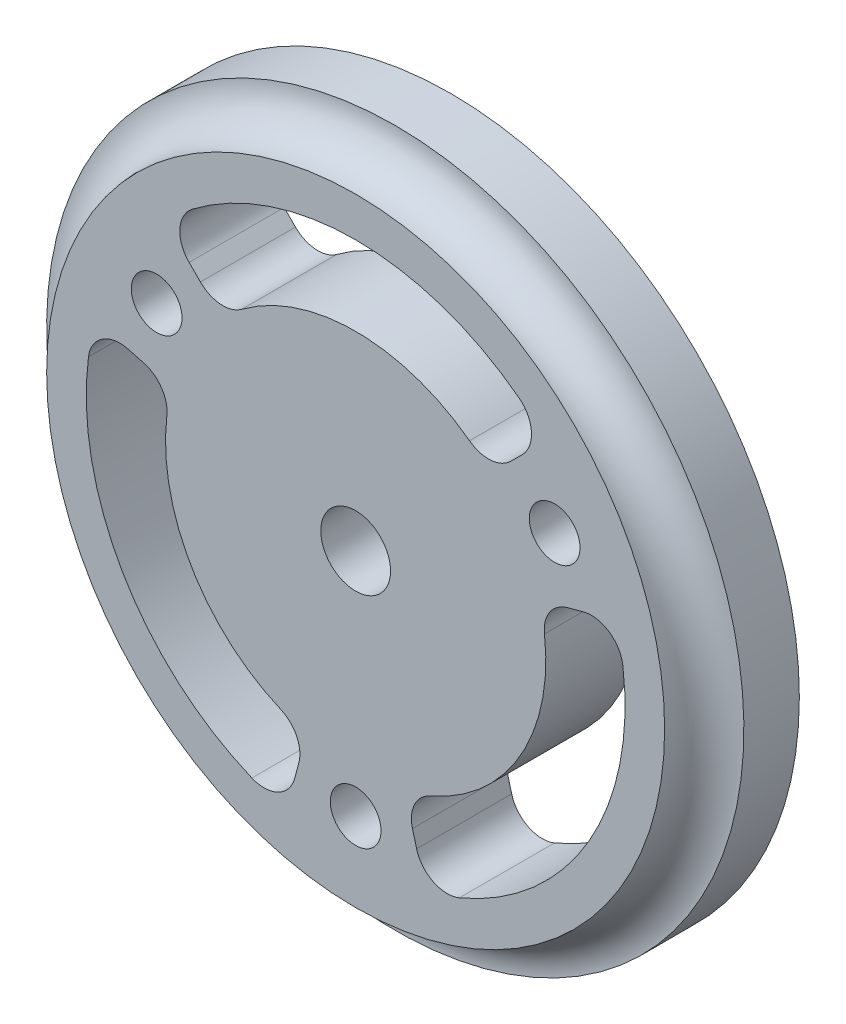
ISO-10303-21;
HEADER;
FILE_DESCRIPTION(('STEP AP214'),'2;1');
FILE_NAME('part.step','',(''),(''),'','','');
FILE_SCHEMA(('AUTOMOTIVE_DESIGN { 1 0 10303 214 1 1 1 1 }'));
ENDSEC;
DATA;
#1=APPLICATION_CONTEXT('core data for automotive mechanical design processes');
#2=APPLICATION_PROTOCOL_DEFINITION('international standard','automotive_design',2000,#1);
#3=PRODUCT_CONTEXT('',#1,'mechanical');
#4=PRODUCT('Part','Part','',(#3));
#5=PRODUCT_RELATED_PRODUCT_CATEGORY('part','',(#4));
#6=PRODUCT_DEFINITION_FORMATION('','',#4);
#7=PRODUCT_DEFINITION_CONTEXT('part definition',#1,'design');
#8=PRODUCT_DEFINITION('design','',#6,#7);
#9=PRODUCT_DEFINITION_SHAPE('','',#8);
#10=(LENGTH_UNIT() NAMED_UNIT(*) SI_UNIT(.MILLI.,.METRE.));
#11=(NAMED_UNIT(*) PLANE_ANGLE_UNIT() SI_UNIT($,.RADIAN.));
#12=(NAMED_UNIT(*) SI_UNIT($,.STERADIAN.) SOLID_ANGLE_UNIT());
#13=UNCERTAINTY_MEASURE_WITH_UNIT(LENGTH_MEASURE(1.E-05),#10,'distance_accuracy_value','');
#14=(GEOMETRIC_REPRESENTATION_CONTEXT(3) GLOBAL_UNCERTAINTY_ASSIGNED_CONTEXT((#13)) GLOBAL_UNIT_ASSIGNED_CONTEXT((#10,
#11,#12)) REPRESENTATION_CONTEXT('',''));
#15=CARTESIAN_POINT('',(0.,0.,0.));
#16=DIRECTION('',(0.,0.,1.));
#17=DIRECTION('',(1.,0.,0.));
#18=AXIS2_PLACEMENT_3D('',#15,#16,#17);
#19=CARTESIAN_POINT('',(0.,0.,6.));
#20=DIRECTION('',(0.,0.,1.));
#21=DIRECTION('',(1.,0.,0.));
#22=AXIS2_PLACEMENT_3D('',#19,#20,#21);
#23=PLANE('',#22);
#24=CARTESIAN_POINT('',(0.,0.,5.99999999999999));
#25=DIRECTION('',(0.,0.,-1.));
#26=DIRECTION('',(0.,1.,0.));
#27=AXIS2_PLACEMENT_3D('',#24,#25,#26);
#28=CIRCLE('',#27,19.5);
#29=CARTESIAN_POINT('',(0.,19.5,6.));
#30=VERTEX_POINT('',#29);
#31=EDGE_CURVE('E426',#30,#30,#28,.T.);
#32=ORIENTED_EDGE('',*,*,#31,.F.);
#33=EDGE_LOOP('',(#32));
#34=FACE_BOUND('',#33,.T.);
#35=CARTESIAN_POINT('',(0.,0.,6.));
#36=DIRECTION('',(0.,0.,1.));
#37=DIRECTION('',(1.,0.,0.));
#38=AXIS2_PLACEMENT_3D('',#35,#36,#37);
#39=CIRCLE('',#38,17.0000000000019);
#40=CARTESIAN_POINT('',(6.55006981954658,-15.6874658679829,6.));
#41=VERTEX_POINT('',#40);
#42=CARTESIAN_POINT('',(16.8607788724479,2.17120607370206,6.));
#43=VERTEX_POINT('',#42);
#44=EDGE_CURVE('E262',#41,#43,#39,.T.);
#45=ORIENTED_EDGE('',*,*,#44,.F.);
#46=CARTESIAN_POINT('',(5.77947337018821,-13.8418816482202,6.));
#47=DIRECTION('',(0.,0.,1.));
#48=DIRECTION('',(-1.,0.,0.));
#49=AXIS2_PLACEMENT_3D('',#46,#47,#48);
#50=CIRCLE('',#49,2.00000000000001);
#51=CARTESIAN_POINT('',(3.84762171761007,-14.3595197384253,6.));
#52=VERTEX_POINT('',#51);
#53=EDGE_CURVE('E260',#52,#41,#50,.T.);
#54=ORIENTED_EDGE('',*,*,#53,.F.);
#55=DIRECTION('',(0.258819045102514,-0.96592582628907,0.));
#56=VECTOR('',#55,1.);
#57=CARTESIAN_POINT('',(3.58630188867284,-13.3842608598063,6.));
#58=LINE('',#57,#56);
#59=CARTESIAN_POINT('',(3.58630188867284,-13.3842608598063,6.));
#60=VERTEX_POINT('',#59);
#61=EDGE_CURVE('E276',#60,#52,#58,.T.);
#62=ORIENTED_EDGE('',*,*,#61,.F.);
#63=CARTESIAN_POINT('',(5.51815354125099,-12.8666227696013,6.));
#64=DIRECTION('',(0.,0.,1.));
#65=DIRECTION('',(1.,0.,0.));
#66=AXIS2_PLACEMENT_3D('',#63,#64,#65);
#67=CIRCLE('',#66,1.99999999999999);
#68=CARTESIAN_POINT('',(4.72984589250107,-11.0285338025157,6.));
#69=VERTEX_POINT('',#68);
#70=EDGE_CURVE('E273',#69,#60,#67,.T.);
#71=ORIENTED_EDGE('',*,*,#70,.F.);
#72=CARTESIAN_POINT('',(0.,0.,6.));
#73=DIRECTION('',(0.,0.,-1.));
#74=DIRECTION('',(1.,0.,0.));
#75=AXIS2_PLACEMENT_3D('',#72,#73,#74);
#76=CIRCLE('',#75,12.0000000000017);
#77=CARTESIAN_POINT('',(11.9159133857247,1.41810020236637,6.));
#78=VERTEX_POINT('',#77);
#79=EDGE_CURVE('E271',#78,#69,#76,.T.);
#80=ORIENTED_EDGE('',*,*,#79,.F.);
#81=CARTESIAN_POINT('',(13.9018989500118,1.65445023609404,6.));
#82=DIRECTION('',(0.,0.,1.));
#83=DIRECTION('',(-1.,0.,0.));
#84=AXIS2_PLACEMENT_3D('',#81,#82,#83);
#85=CIRCLE('',#84,1.99999999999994);
#86=CARTESIAN_POINT('',(13.3842608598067,3.58630188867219,6.));
#87=VERTEX_POINT('',#86);
#88=EDGE_CURVE('E269',#87,#78,#85,.T.);
#89=ORIENTED_EDGE('',*,*,#88,.F.);
#90=DIRECTION('',(-0.96592582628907,-0.258819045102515,0.));
#91=VECTOR('',#90,1.);
#92=CARTESIAN_POINT('',(13.3842608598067,3.58630188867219,6.));
#93=LINE('',#92,#91);
#94=CARTESIAN_POINT('',(14.3595197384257,3.84762171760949,6.));
#95=VERTEX_POINT('',#94);
#96=EDGE_CURVE('E267',#95,#87,#93,.T.);
#97=ORIENTED_EDGE('',*,*,#96,.F.);
#98=CARTESIAN_POINT('',(14.8771578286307,1.91577006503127,6.));
#99=DIRECTION('',(0.,0.,1.));
#100=DIRECTION('',(1.,0.,0.));
#101=AXIS2_PLACEMENT_3D('',#98,#99,#100);
#102=CIRCLE('',#101,2.00000000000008);
#103=EDGE_CURVE('E265',#43,#95,#102,.T.);
#104=ORIENTED_EDGE('',*,*,#103,.F.);
#105=EDGE_LOOP('',(#45,#54,#62,#71,#80,#89,#97,#104));
#106=FACE_BOUND('',#105,.T.);
#107=CARTESIAN_POINT('',(12.5573683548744,7.24999999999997,6.));
#108=DIRECTION('',(0.,0.,1.));
#109=DIRECTION('',(1.,0.,0.));
#110=AXIS2_PLACEMENT_3D('',#107,#108,#109);
#111=CIRCLE('',#110,1.59999999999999);
#112=CARTESIAN_POINT('',(14.1573683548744,7.24999999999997,6.));
#113=VERTEX_POINT('',#112);
#114=EDGE_CURVE('E325',#113,#113,#111,.T.);
#115=ORIENTED_EDGE('',*,*,#114,.F.);
#116=EDGE_LOOP('',(#115));
#117=FACE_BOUND('',#116,.T.);
#118=CARTESIAN_POINT('',(-9.09768445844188,11.9261115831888,6.));
#119=DIRECTION('',(0.,0.,1.));
#120=DIRECTION('',(1.,0.,0.));
#121=AXIS2_PLACEMENT_3D('',#118,#119,#120);
#122=CIRCLE('',#121,2.00000000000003);
#123=CARTESIAN_POINT('',(-10.3107090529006,13.5162597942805,6.));
#124=VERTEX_POINT('',#123);
#125=CARTESIAN_POINT('',(-10.511898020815,10.5118980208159,6.));
#126=VERTEX_POINT('',#125);
#127=EDGE_CURVE('E339',#124,#126,#122,.T.);
#128=ORIENTED_EDGE('',*,*,#127,.F.);
#129=CARTESIAN_POINT('',(0.,0.,6.));
#130=DIRECTION('',(0.,0.,1.));
#131=DIRECTION('',(1.,0.,0.));
#132=AXIS2_PLACEMENT_3D('',#129,#130,#131);
#133=CIRCLE('',#132,17.0000000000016);
#134=CARTESIAN_POINT('',(10.3107090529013,13.5162597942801,6.));
#135=VERTEX_POINT('',#134);
#136=EDGE_CURVE('E337',#135,#124,#133,.T.);
#137=ORIENTED_EDGE('',*,*,#136,.F.);
#138=CARTESIAN_POINT('',(9.09768445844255,11.9261115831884,6.));
#139=DIRECTION('',(0.,0.,1.));
#140=DIRECTION('',(-1.,0.,0.));
#141=AXIS2_PLACEMENT_3D('',#138,#139,#140);
#142=CIRCLE('',#141,1.99999999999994);
#143=CARTESIAN_POINT('',(10.5118980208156,10.5118980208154,6.));
#144=VERTEX_POINT('',#143);
#145=EDGE_CURVE('E353',#144,#135,#142,.T.);
#146=ORIENTED_EDGE('',*,*,#145,.F.);
#147=DIRECTION('',(0.70710678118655,0.707106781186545,0.));
#148=VECTOR('',#147,1.);
#149=CARTESIAN_POINT('',(9.79795897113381,9.79795897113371,6.));
#150=LINE('',#149,#148);
#151=CARTESIAN_POINT('',(9.79795897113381,9.79795897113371,6.));
#152=VERTEX_POINT('',#151);
#153=EDGE_CURVE('E350',#152,#144,#150,.T.);
#154=ORIENTED_EDGE('',*,*,#153,.F.);
#155=CARTESIAN_POINT('',(8.38374540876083,11.2121725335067,6.));
#156=DIRECTION('',(0.,0.,1.));
#157=DIRECTION('',(1.,0.,0.));
#158=AXIS2_PLACEMENT_3D('',#155,#156,#157);
#159=CIRCLE('',#158,1.99999999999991);
#160=CARTESIAN_POINT('',(7.18606749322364,9.61043360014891,6.));
#161=VERTEX_POINT('',#160);
#162=EDGE_CURVE('E348',#161,#152,#159,.T.);
#163=ORIENTED_EDGE('',*,*,#162,.F.);
#164=CARTESIAN_POINT('',(0.,0.,6.));
#165=DIRECTION('',(0.,0.,-1.));
#166=DIRECTION('',(1.,0.,0.));
#167=AXIS2_PLACEMENT_3D('',#164,#165,#166);
#168=CIRCLE('',#167,12.0000000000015);
#169=CARTESIAN_POINT('',(-7.18606749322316,9.61043360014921,6.));
#170=VERTEX_POINT('',#169);
#171=EDGE_CURVE('E346',#170,#161,#168,.T.);
#172=ORIENTED_EDGE('',*,*,#171,.F.);
#173=CARTESIAN_POINT('',(-8.38374540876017,11.212172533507,6.));
#174=DIRECTION('',(0.,0.,1.));
#175=DIRECTION('',(-1.,0.,0.));
#176=AXIS2_PLACEMENT_3D('',#173,#174,#175);
#177=CIRCLE('',#176,1.99999999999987);
#178=CARTESIAN_POINT('',(-9.79795897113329,9.79795897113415,6.));
#179=VERTEX_POINT('',#178);
#180=EDGE_CURVE('E344',#179,#170,#177,.T.);
#181=ORIENTED_EDGE('',*,*,#180,.F.);
#182=DIRECTION('',(0.707106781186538,-0.707106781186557,0.));
#183=VECTOR('',#182,1.);
#184=CARTESIAN_POINT('',(-9.79795897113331,9.79795897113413,6.));
#185=LINE('',#184,#183);
#186=EDGE_CURVE('E342',#126,#179,#185,.T.);
#187=ORIENTED_EDGE('',*,*,#186,.F.);
#188=EDGE_LOOP('',(#128,#137,#146,#154,#163,#172,#181,#187));
#189=FACE_BOUND('',#188,.T.);
#190=CARTESIAN_POINT('',(0.,0.,6.));
#191=DIRECTION('',(0.,0.,1.));
#192=DIRECTION('',(1.,0.,0.));
#193=AXIS2_PLACEMENT_3D('',#190,#191,#192);
#194=CIRCLE('',#193,2.2);
#195=CARTESIAN_POINT('',(2.2,0.,6.));
#196=VERTEX_POINT('',#195);
#197=EDGE_CURVE('E40',#196,#196,#194,.T.);
#198=ORIENTED_EDGE('',*,*,#197,.F.);
#199=EDGE_LOOP('',(#198));
#200=FACE_BOUND('',#199,.T.);
#201=CARTESIAN_POINT('',(0.,-14.5,6.));
#202=DIRECTION('',(0.,0.,1.));
#203=DIRECTION('',(1.,0.,0.));
#204=AXIS2_PLACEMENT_3D('',#201,#202,#203);
#205=CIRCLE('',#204,1.59999999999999);
#206=CARTESIAN_POINT('',(1.5999999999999,-14.5,6.));
#207=VERTEX_POINT('',#206);
#208=EDGE_CURVE('E331',#207,#207,#205,.T.);
#209=ORIENTED_EDGE('',*,*,#208,.F.);
#210=EDGE_LOOP('',(#209));
#211=FACE_BOUND('',#210,.T.);
#212=CARTESIAN_POINT('',(-12.5573683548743,7.25000000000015,6.));
#213=DIRECTION('',(0.,0.,1.));
#214=DIRECTION('',(1.,0.,0.));
#215=AXIS2_PLACEMENT_3D('',#212,#213,#214);
#216=CIRCLE('',#215,1.59999999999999);
#217=CARTESIAN_POINT('',(-10.9573683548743,7.25000000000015,6.));
#218=VERTEX_POINT('',#217);
#219=EDGE_CURVE('E319',#218,#218,#216,.T.);
#220=ORIENTED_EDGE('',*,*,#219,.F.);
#221=EDGE_LOOP('',(#220));
#222=FACE_BOUND('',#221,.T.);
#223=CARTESIAN_POINT('',(0.,0.,6.));
#224=DIRECTION('',(0.,0.,1.));
#225=DIRECTION('',(1.,0.,0.));
#226=AXIS2_PLACEMENT_3D('',#223,#224,#225);
#227=CIRCLE('',#226,17.0000000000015);
#228=CARTESIAN_POINT('',(-16.8607788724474,2.1712060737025,6.));
#229=VERTEX_POINT('',#228);
#230=CARTESIAN_POINT('',(-6.55006981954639,-15.6874658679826,6.));
#231=VERTEX_POINT('',#230);
#232=EDGE_CURVE('E201',#229,#231,#227,.T.);
#233=ORIENTED_EDGE('',*,*,#232,.F.);
#234=CARTESIAN_POINT('',(-14.87715782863,1.91577006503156,6.));
#235=DIRECTION('',(0.,0.,1.));
#236=DIRECTION('',(-1.,0.,0.));
#237=AXIS2_PLACEMENT_3D('',#234,#235,#236);
#238=CIRCLE('',#237,2.00000000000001);
#239=CARTESIAN_POINT('',(-14.3595197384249,3.8476217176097,6.));
#240=VERTEX_POINT('',#239);
#241=EDGE_CURVE('E193',#240,#229,#238,.T.);
#242=ORIENTED_EDGE('',*,*,#241,.F.);
#243=DIRECTION('',(-0.965925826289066,0.258819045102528,0.));
#244=VECTOR('',#243,1.);
#245=CARTESIAN_POINT('',(-13.384260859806,3.58630188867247,6.));
#246=LINE('',#245,#244);
#247=CARTESIAN_POINT('',(-13.384260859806,3.58630188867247,6.));
#248=VERTEX_POINT('',#247);
#249=EDGE_CURVE('E227',#248,#240,#246,.T.);
#250=ORIENTED_EDGE('',*,*,#249,.F.);
#251=CARTESIAN_POINT('',(-13.901898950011,1.65445023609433,6.));
#252=DIRECTION('',(0.,0.,1.));
#253=DIRECTION('',(1.,0.,0.));
#254=AXIS2_PLACEMENT_3D('',#251,#252,#253);
#255=CIRCLE('',#254,1.99999999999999);
#256=CARTESIAN_POINT('',(-11.9159133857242,1.41810020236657,6.));
#257=VERTEX_POINT('',#256);
#258=EDGE_CURVE('E225',#257,#248,#255,.T.);
#259=ORIENTED_EDGE('',*,*,#258,.F.);
#260=CARTESIAN_POINT('',(0.,0.,6.));
#261=DIRECTION('',(0.,0.,-1.));
#262=DIRECTION('',(1.,0.,0.));
#263=AXIS2_PLACEMENT_3D('',#260,#261,#262);
#264=CIRCLE('',#263,12.0000000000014);
#265=CARTESIAN_POINT('',(-4.72984589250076,-11.0285338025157,6.));
#266=VERTEX_POINT('',#265);
#267=EDGE_CURVE('E223',#266,#257,#264,.T.);
#268=ORIENTED_EDGE('',*,*,#267,.F.);
#269=CARTESIAN_POINT('',(-5.51815354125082,-12.8666227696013,6.));
#270=DIRECTION('',(0.,0.,1.));
#271=DIRECTION('',(-1.,0.,0.));
#272=AXIS2_PLACEMENT_3D('',#269,#270,#271);
#273=CIRCLE('',#272,1.99999999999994);
#274=CARTESIAN_POINT('',(-3.58630188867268,-13.3842608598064,6.));
#275=VERTEX_POINT('',#274);
#276=EDGE_CURVE('E221',#275,#266,#273,.T.);
#277=ORIENTED_EDGE('',*,*,#276,.F.);
#278=DIRECTION('',(0.258819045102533,0.965925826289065,0.));
#279=VECTOR('',#278,1.);
#280=CARTESIAN_POINT('',(-3.58630188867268,-13.3842608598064,6.));
#281=LINE('',#280,#279);
#282=CARTESIAN_POINT('',(-3.84762171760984,-14.3595197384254,6.));
#283=VERTEX_POINT('',#282);
#284=EDGE_CURVE('E216',#283,#275,#281,.T.);
#285=ORIENTED_EDGE('',*,*,#284,.F.);
#286=CARTESIAN_POINT('',(-5.77947337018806,-13.8418816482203,6.));
#287=DIRECTION('',(0.,0.,1.));
#288=DIRECTION('',(1.,0.,0.));
#289=AXIS2_PLACEMENT_3D('',#286,#287,#288);
#290=CIRCLE('',#289,2.00000000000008);
#291=EDGE_CURVE('E214',#231,#283,#290,.T.);
#292=ORIENTED_EDGE('',*,*,#291,.F.);
#293=EDGE_LOOP('',(#233,#242,#250,#259,#268,#277,#285,#292));
#294=FACE_BOUND('',#293,.T.);
#295=ADVANCED_FACE('F32',(#34,#106,#117,#189,#200,#211,#222,#294),#23,.T.);
#296=CARTESIAN_POINT('',(0.,0.,0.));
#297=DIRECTION('',(0.,0.,1.));
#298=DIRECTION('',(1.,0.,0.));
#299=AXIS2_PLACEMENT_3D('',#296,#297,#298);
#300=PLANE('',#299);
#301=CARTESIAN_POINT('',(5.77947337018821,-13.8418816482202,0.));
#302=DIRECTION('',(0.,0.,1.));
#303=DIRECTION('',(-1.,0.,0.));
#304=AXIS2_PLACEMENT_3D('',#301,#302,#303);
#305=CIRCLE('',#304,2.00000000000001);
#306=CARTESIAN_POINT('',(3.84762171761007,-14.3595197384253,0.));
#307=VERTEX_POINT('',#306);
#308=CARTESIAN_POINT('',(6.55006981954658,-15.6874658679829,0.));
#309=VERTEX_POINT('',#308);
#310=EDGE_CURVE('E209',#307,#309,#305,.T.);
#311=ORIENTED_EDGE('',*,*,#310,.T.);
#312=CARTESIAN_POINT('',(0.,0.,0.));
#313=DIRECTION('',(0.,0.,1.));
#314=DIRECTION('',(1.,0.,0.));
#315=AXIS2_PLACEMENT_3D('',#312,#313,#314);
#316=CIRCLE('',#315,17.0000000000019);
#317=CARTESIAN_POINT('',(16.8607788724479,2.17120607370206,0.));
#318=VERTEX_POINT('',#317);
#319=EDGE_CURVE('E281',#309,#318,#316,.T.);
#320=ORIENTED_EDGE('',*,*,#319,.T.);
#321=CARTESIAN_POINT('',(14.8771578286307,1.91577006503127,0.));
#322=DIRECTION('',(0.,0.,1.));
#323=DIRECTION('',(1.,0.,0.));
#324=AXIS2_PLACEMENT_3D('',#321,#322,#323);
#325=CIRCLE('',#324,2.00000000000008);
#326=CARTESIAN_POINT('',(14.3595197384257,3.84762171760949,0.));
#327=VERTEX_POINT('',#326);
#328=EDGE_CURVE('E284',#318,#327,#325,.T.);
#329=ORIENTED_EDGE('',*,*,#328,.T.);
#330=DIRECTION('',(-0.96592582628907,-0.258819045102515,0.));
#331=VECTOR('',#330,1.);
#332=CARTESIAN_POINT('',(13.3842608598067,3.58630188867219,0.));
#333=LINE('',#332,#331);
#334=CARTESIAN_POINT('',(13.3842608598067,3.58630188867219,0.));
#335=VERTEX_POINT('',#334);
#336=EDGE_CURVE('E287',#327,#335,#333,.T.);
#337=ORIENTED_EDGE('',*,*,#336,.T.);
#338=CARTESIAN_POINT('',(13.9018989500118,1.65445023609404,0.));
#339=DIRECTION('',(0.,0.,1.));
#340=DIRECTION('',(-1.,0.,0.));
#341=AXIS2_PLACEMENT_3D('',#338,#339,#340);
#342=CIRCLE('',#341,1.99999999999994);
#343=CARTESIAN_POINT('',(11.9159133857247,1.41810020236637,0.));
#344=VERTEX_POINT('',#343);
#345=EDGE_CURVE('E290',#335,#344,#342,.T.);
#346=ORIENTED_EDGE('',*,*,#345,.T.);
#347=CARTESIAN_POINT('',(0.,0.,0.));
#348=DIRECTION('',(0.,0.,-1.));
#349=DIRECTION('',(1.,0.,0.));
#350=AXIS2_PLACEMENT_3D('',#347,#348,#349);
#351=CIRCLE('',#350,12.0000000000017);
#352=CARTESIAN_POINT('',(4.72984589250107,-11.0285338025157,0.));
#353=VERTEX_POINT('',#352);
#354=EDGE_CURVE('E293',#344,#353,#351,.T.);
#355=ORIENTED_EDGE('',*,*,#354,.T.);
#356=CARTESIAN_POINT('',(5.51815354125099,-12.8666227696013,0.));
#357=DIRECTION('',(0.,0.,1.));
#358=DIRECTION('',(1.,0.,0.));
#359=AXIS2_PLACEMENT_3D('',#356,#357,#358);
#360=CIRCLE('',#359,1.99999999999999);
#361=CARTESIAN_POINT('',(3.58630188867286,-13.3842608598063,0.));
#362=VERTEX_POINT('',#361);
#363=EDGE_CURVE('E296',#353,#362,#360,.T.);
#364=ORIENTED_EDGE('',*,*,#363,.T.);
#365=DIRECTION('',(0.258819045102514,-0.96592582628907,0.));
#366=VECTOR('',#365,1.);
#367=CARTESIAN_POINT('',(3.58630188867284,-13.3842608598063,0.));
#368=LINE('',#367,#366);
#369=EDGE_CURVE('E263',#362,#307,#368,.T.);
#370=ORIENTED_EDGE('',*,*,#369,.T.);
#371=EDGE_LOOP('',(#311,#320,#329,#337,#346,#355,#364,#370));
#372=FACE_BOUND('',#371,.T.);
#373=CARTESIAN_POINT('',(12.5573683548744,7.24999999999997,0.));
#374=DIRECTION('',(0.,0.,1.));
#375=DIRECTION('',(1.,0.,0.));
#376=AXIS2_PLACEMENT_3D('',#373,#374,#375);
#377=CIRCLE('',#376,1.59999999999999);
#378=CARTESIAN_POINT('',(14.1573683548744,7.24999999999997,0.));
#379=VERTEX_POINT('',#378);
#380=EDGE_CURVE('E322',#379,#379,#377,.T.);
#381=ORIENTED_EDGE('',*,*,#380,.T.);
#382=EDGE_LOOP('',(#381));
#383=FACE_BOUND('',#382,.T.);
#384=CARTESIAN_POINT('',(0.,0.,0.));
#385=DIRECTION('',(0.,0.,1.));
#386=DIRECTION('',(1.,0.,0.));
#387=AXIS2_PLACEMENT_3D('',#384,#385,#386);
#388=CIRCLE('',#387,17.0000000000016);
#389=CARTESIAN_POINT('',(10.3107090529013,13.5162597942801,0.));
#390=VERTEX_POINT('',#389);
#391=CARTESIAN_POINT('',(-10.3107090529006,13.5162597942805,0.));
#392=VERTEX_POINT('',#391);
#393=EDGE_CURVE('E334',#390,#392,#388,.T.);
#394=ORIENTED_EDGE('',*,*,#393,.T.);
#395=CARTESIAN_POINT('',(-9.09768445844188,11.9261115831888,0.));
#396=DIRECTION('',(0.,0.,1.));
#397=DIRECTION('',(1.,0.,0.));
#398=AXIS2_PLACEMENT_3D('',#395,#396,#397);
#399=CIRCLE('',#398,2.00000000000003);
#400=CARTESIAN_POINT('',(-10.511898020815,10.5118980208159,0.));
#401=VERTEX_POINT('',#400);
#402=EDGE_CURVE('E358',#392,#401,#399,.T.);
#403=ORIENTED_EDGE('',*,*,#402,.T.);
#404=DIRECTION('',(0.707106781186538,-0.707106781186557,0.));
#405=VECTOR('',#404,1.);
#406=CARTESIAN_POINT('',(-9.79795897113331,9.79795897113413,0.));
#407=LINE('',#406,#405);
#408=CARTESIAN_POINT('',(-9.79795897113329,9.79795897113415,0.));
#409=VERTEX_POINT('',#408);
#410=EDGE_CURVE('E361',#401,#409,#407,.T.);
#411=ORIENTED_EDGE('',*,*,#410,.T.);
#412=CARTESIAN_POINT('',(-8.38374540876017,11.212172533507,0.));
#413=DIRECTION('',(0.,0.,1.));
#414=DIRECTION('',(-1.,0.,0.));
#415=AXIS2_PLACEMENT_3D('',#412,#413,#414);
#416=CIRCLE('',#415,1.99999999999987);
#417=CARTESIAN_POINT('',(-7.18606749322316,9.61043360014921,0.));
#418=VERTEX_POINT('',#417);
#419=EDGE_CURVE('E364',#409,#418,#416,.T.);
#420=ORIENTED_EDGE('',*,*,#419,.T.);
#421=CARTESIAN_POINT('',(0.,0.,0.));
#422=DIRECTION('',(0.,0.,-1.));
#423=DIRECTION('',(1.,0.,0.));
#424=AXIS2_PLACEMENT_3D('',#421,#422,#423);
#425=CIRCLE('',#424,12.0000000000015);
#426=CARTESIAN_POINT('',(7.18606749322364,9.61043360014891,0.));
#427=VERTEX_POINT('',#426);
#428=EDGE_CURVE('E367',#418,#427,#425,.T.);
#429=ORIENTED_EDGE('',*,*,#428,.T.);
#430=CARTESIAN_POINT('',(8.38374540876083,11.2121725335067,0.));
#431=DIRECTION('',(0.,0.,1.));
#432=DIRECTION('',(1.,0.,0.));
#433=AXIS2_PLACEMENT_3D('',#430,#431,#432);
#434=CIRCLE('',#433,1.99999999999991);
#435=CARTESIAN_POINT('',(9.79795897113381,9.79795897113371,0.));
#436=VERTEX_POINT('',#435);
#437=EDGE_CURVE('E370',#427,#436,#434,.T.);
#438=ORIENTED_EDGE('',*,*,#437,.T.);
#439=DIRECTION('',(0.70710678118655,0.707106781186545,0.));
#440=VECTOR('',#439,1.);
#441=CARTESIAN_POINT('',(9.79795897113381,9.79795897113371,0.));
#442=LINE('',#441,#440);
#443=CARTESIAN_POINT('',(10.5118980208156,10.5118980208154,0.));
#444=VERTEX_POINT('',#443);
#445=EDGE_CURVE('E373',#436,#444,#442,.T.);
#446=ORIENTED_EDGE('',*,*,#445,.T.);
#447=CARTESIAN_POINT('',(9.09768445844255,11.9261115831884,0.));
#448=DIRECTION('',(0.,0.,1.));
#449=DIRECTION('',(-1.,0.,0.));
#450=AXIS2_PLACEMENT_3D('',#447,#448,#449);
#451=CIRCLE('',#450,1.99999999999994);
#452=EDGE_CURVE('E340',#444,#390,#451,.T.);
#453=ORIENTED_EDGE('',*,*,#452,.T.);
#454=EDGE_LOOP('',(#394,#403,#411,#420,#429,#438,#446,#453));
#455=FACE_BOUND('',#454,.T.);
#456=CARTESIAN_POINT('',(0.,0.,0.));
#457=DIRECTION('',(0.,0.,1.));
#458=DIRECTION('',(1.,0.,0.));
#459=AXIS2_PLACEMENT_3D('',#456,#457,#458);
#460=CIRCLE('',#459,22.);
#461=CARTESIAN_POINT('',(22.,0.,0.));
#462=VERTEX_POINT('',#461);
#463=EDGE_CURVE('E11',#462,#462,#460,.T.);
#464=ORIENTED_EDGE('',*,*,#463,.F.);
#465=EDGE_LOOP('',(#464));
#466=FACE_BOUND('',#465,.T.);
#467=CARTESIAN_POINT('',(0.,0.,0.));
#468=DIRECTION('',(0.,0.,1.));
#469=DIRECTION('',(1.,0.,0.));
#470=AXIS2_PLACEMENT_3D('',#467,#468,#469);
#471=CIRCLE('',#470,2.2);
#472=CARTESIAN_POINT('',(2.2,0.,0.));
#473=VERTEX_POINT('',#472);
#474=EDGE_CURVE('E395',#473,#473,#471,.T.);
#475=ORIENTED_EDGE('',*,*,#474,.T.);
#476=EDGE_LOOP('',(#475));
#477=FACE_BOUND('',#476,.T.);
#478=CARTESIAN_POINT('',(0.,-14.5,0.));
#479=DIRECTION('',(0.,0.,1.));
#480=DIRECTION('',(1.,0.,0.));
#481=AXIS2_PLACEMENT_3D('',#478,#479,#480);
#482=CIRCLE('',#481,1.59999999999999);
#483=CARTESIAN_POINT('',(1.5999999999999,-14.5,0.));
#484=VERTEX_POINT('',#483);
#485=EDGE_CURVE('E328',#484,#484,#482,.T.);
#486=ORIENTED_EDGE('',*,*,#485,.T.);
#487=EDGE_LOOP('',(#486));
#488=FACE_BOUND('',#487,.T.);
#489=CARTESIAN_POINT('',(-12.5573683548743,7.25000000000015,0.));
#490=DIRECTION('',(0.,0.,1.));
#491=DIRECTION('',(1.,0.,0.));
#492=AXIS2_PLACEMENT_3D('',#489,#490,#491);
#493=CIRCLE('',#492,1.59999999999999);
#494=CARTESIAN_POINT('',(-10.9573683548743,7.25000000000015,0.));
#495=VERTEX_POINT('',#494);
#496=EDGE_CURVE('E318',#495,#495,#493,.T.);
#497=ORIENTED_EDGE('',*,*,#496,.T.);
#498=EDGE_LOOP('',(#497));
#499=FACE_BOUND('',#498,.T.);
#500=CARTESIAN_POINT('',(-14.87715782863,1.91577006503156,0.));
#501=DIRECTION('',(0.,0.,1.));
#502=DIRECTION('',(-1.,0.,0.));
#503=AXIS2_PLACEMENT_3D('',#500,#501,#502);
#504=CIRCLE('',#503,2.00000000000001);
#505=CARTESIAN_POINT('',(-14.3595197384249,3.8476217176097,0.));
#506=VERTEX_POINT('',#505);
#507=CARTESIAN_POINT('',(-16.8607788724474,2.1712060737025,0.));
#508=VERTEX_POINT('',#507);
#509=EDGE_CURVE('E55',#506,#508,#504,.T.);
#510=ORIENTED_EDGE('',*,*,#509,.T.);
#511=CARTESIAN_POINT('',(0.,0.,0.));
#512=DIRECTION('',(0.,0.,1.));
#513=DIRECTION('',(1.,0.,0.));
#514=AXIS2_PLACEMENT_3D('',#511,#512,#513);
#515=CIRCLE('',#514,17.0000000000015);
#516=CARTESIAN_POINT('',(-6.55006981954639,-15.6874658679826,0.));
#517=VERTEX_POINT('',#516);
#518=EDGE_CURVE('E208',#508,#517,#515,.T.);
#519=ORIENTED_EDGE('',*,*,#518,.T.);
#520=CARTESIAN_POINT('',(-5.77947337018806,-13.8418816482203,0.));
#521=DIRECTION('',(0.,0.,1.));
#522=DIRECTION('',(1.,0.,0.));
#523=AXIS2_PLACEMENT_3D('',#520,#521,#522);
#524=CIRCLE('',#523,2.00000000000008);
#525=CARTESIAN_POINT('',(-3.84762171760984,-14.3595197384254,0.));
#526=VERTEX_POINT('',#525);
#527=EDGE_CURVE('E232',#517,#526,#524,.T.);
#528=ORIENTED_EDGE('',*,*,#527,.T.);
#529=DIRECTION('',(0.258819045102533,0.965925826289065,0.));
#530=VECTOR('',#529,1.);
#531=CARTESIAN_POINT('',(-3.58630188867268,-13.3842608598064,0.));
#532=LINE('',#531,#530);
#533=CARTESIAN_POINT('',(-3.58630188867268,-13.3842608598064,0.));
#534=VERTEX_POINT('',#533);
#535=EDGE_CURVE('E235',#526,#534,#532,.T.);
#536=ORIENTED_EDGE('',*,*,#535,.T.);
#537=CARTESIAN_POINT('',(-5.51815354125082,-12.8666227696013,0.));
#538=DIRECTION('',(0.,0.,1.));
#539=DIRECTION('',(-1.,0.,0.));
#540=AXIS2_PLACEMENT_3D('',#537,#538,#539);
#541=CIRCLE('',#540,1.99999999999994);
#542=CARTESIAN_POINT('',(-4.72984589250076,-11.0285338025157,0.));
#543=VERTEX_POINT('',#542);
#544=EDGE_CURVE('E238',#534,#543,#541,.T.);
#545=ORIENTED_EDGE('',*,*,#544,.T.);
#546=CARTESIAN_POINT('',(0.,0.,0.));
#547=DIRECTION('',(0.,0.,-1.));
#548=DIRECTION('',(1.,0.,0.));
#549=AXIS2_PLACEMENT_3D('',#546,#547,#548);
#550=CIRCLE('',#549,12.0000000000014);
#551=CARTESIAN_POINT('',(-11.9159133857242,1.41810020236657,0.));
#552=VERTEX_POINT('',#551);
#553=EDGE_CURVE('E241',#543,#552,#550,.T.);
#554=ORIENTED_EDGE('',*,*,#553,.T.);
#555=CARTESIAN_POINT('',(-13.901898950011,1.65445023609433,0.));
#556=DIRECTION('',(0.,0.,1.));
#557=DIRECTION('',(1.,0.,0.));
#558=AXIS2_PLACEMENT_3D('',#555,#556,#557);
#559=CIRCLE('',#558,1.99999999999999);
#560=CARTESIAN_POINT('',(-13.384260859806,3.58630188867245,0.));
#561=VERTEX_POINT('',#560);
#562=EDGE_CURVE('E244',#552,#561,#559,.T.);
#563=ORIENTED_EDGE('',*,*,#562,.T.);
#564=DIRECTION('',(-0.965925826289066,0.258819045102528,0.));
#565=VECTOR('',#564,1.);
#566=CARTESIAN_POINT('',(-13.384260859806,3.58630188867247,0.));
#567=LINE('',#566,#565);
#568=EDGE_CURVE('E202',#561,#506,#567,.T.);
#569=ORIENTED_EDGE('',*,*,#568,.T.);
#570=EDGE_LOOP('',(#510,#519,#528,#536,#545,#554,#563,#569));
#571=FACE_BOUND('',#570,.T.);
#572=ADVANCED_FACE('F400',(#372,#383,#455,#466,#477,#488,#499,#571),#300,.F.);
#573=CARTESIAN_POINT('',(0.,0.,6.));
#574=DIRECTION('',(0.,0.,-1.));
#575=DIRECTION('',(-1.,0.,0.));
#576=AXIS2_PLACEMENT_3D('',#573,#574,#575);
#577=CYLINDRICAL_SURFACE('',#576,22.);
#578=CARTESIAN_POINT('',(0.,0.,3.5));
#579=DIRECTION('',(0.,0.,-1.));
#580=DIRECTION('',(0.,1.,0.));
#581=AXIS2_PLACEMENT_3D('',#578,#579,#580);
#582=CIRCLE('',#581,22.);
#583=CARTESIAN_POINT('',(0.,22.,3.5));
#584=VERTEX_POINT('',#583);
#585=EDGE_CURVE('E230',#584,#584,#582,.T.);
#586=ORIENTED_EDGE('',*,*,#585,.T.);
#587=EDGE_LOOP('',(#586));
#588=FACE_BOUND('',#587,.T.);
#589=ORIENTED_EDGE('',*,*,#463,.T.);
#590=EDGE_LOOP('',(#589));
#591=FACE_BOUND('',#590,.T.);
#592=ADVANCED_FACE('F34',(#588,#591),#577,.T.);
#593=CARTESIAN_POINT('',(0.,0.,6.));
#594=DIRECTION('',(0.,0.,-1.));
#595=DIRECTION('',(-1.,0.,0.));
#596=AXIS2_PLACEMENT_3D('',#593,#594,#595);
#597=CYLINDRICAL_SURFACE('',#596,2.2);
#598=ORIENTED_EDGE('',*,*,#197,.T.);
#599=EDGE_LOOP('',(#598));
#600=FACE_BOUND('',#599,.T.);
#601=ORIENTED_EDGE('',*,*,#474,.F.);
#602=EDGE_LOOP('',(#601));
#603=FACE_BOUND('',#602,.T.);
#604=ADVANCED_FACE('F403',(#600,#603),#597,.F.);
#605=CARTESIAN_POINT('',(0.,0.,6.));
#606=DIRECTION('',(0.,0.,-1.));
#607=DIRECTION('',(-1.,0.,0.));
#608=AXIS2_PLACEMENT_3D('',#605,#606,#607);
#609=CYLINDRICAL_SURFACE('',#608,17.0000000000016);
#610=ORIENTED_EDGE('',*,*,#393,.F.);
#611=DIRECTION('',(0.,0.,-1.));
#612=VECTOR('',#611,1.);
#613=CARTESIAN_POINT('',(10.3107090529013,13.5162597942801,6.));
#614=LINE('',#613,#612);
#615=EDGE_CURVE('E355',#135,#390,#614,.T.);
#616=ORIENTED_EDGE('',*,*,#615,.F.);
#617=ORIENTED_EDGE('',*,*,#136,.T.);
#618=DIRECTION('',(0.,0.,-1.));
#619=VECTOR('',#618,1.);
#620=CARTESIAN_POINT('',(-10.3107090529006,13.5162597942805,6.));
#621=LINE('',#620,#619);
#622=EDGE_CURVE('E392',#124,#392,#621,.T.);
#623=ORIENTED_EDGE('',*,*,#622,.T.);
#624=EDGE_LOOP('',(#610,#616,#617,#623));
#625=FACE_BOUND('',#624,.T.);
#626=ADVANCED_FACE('F405',(#625),#609,.F.);
#627=CARTESIAN_POINT('',(-9.09768445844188,11.9261115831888,6.));
#628=DIRECTION('',(0.,0.,-1.));
#629=DIRECTION('',(-1.,0.,0.));
#630=AXIS2_PLACEMENT_3D('',#627,#628,#629);
#631=CYLINDRICAL_SURFACE('',#630,2.00000000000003);
#632=ORIENTED_EDGE('',*,*,#402,.F.);
#633=ORIENTED_EDGE('',*,*,#622,.F.);
#634=ORIENTED_EDGE('',*,*,#127,.T.);
#635=DIRECTION('',(0.,0.,-1.));
#636=VECTOR('',#635,1.);
#637=CARTESIAN_POINT('',(-10.511898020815,10.5118980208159,6.));
#638=LINE('',#637,#636);
#639=EDGE_CURVE('E390',#126,#401,#638,.T.);
#640=ORIENTED_EDGE('',*,*,#639,.T.);
#641=EDGE_LOOP('',(#632,#633,#634,#640));
#642=FACE_BOUND('',#641,.T.);
#643=ADVANCED_FACE('F412',(#642),#631,.F.);
#644=CARTESIAN_POINT('',(-9.79795897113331,9.79795897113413,6.));
#645=DIRECTION('',(0.707106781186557,0.707106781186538,0.));
#646=DIRECTION('',(-0.707106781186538,0.707106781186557,0.));
#647=AXIS2_PLACEMENT_3D('',#644,#645,#646);
#648=PLANE('',#647);
#649=ORIENTED_EDGE('',*,*,#410,.F.);
#650=ORIENTED_EDGE('',*,*,#639,.F.);
#651=ORIENTED_EDGE('',*,*,#186,.T.);
#652=DIRECTION('',(0.,0.,-1.));
#653=VECTOR('',#652,1.);
#654=CARTESIAN_POINT('',(-9.79795897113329,9.79795897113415,6.));
#655=LINE('',#654,#653);
#656=EDGE_CURVE('E388',#179,#409,#655,.T.);
#657=ORIENTED_EDGE('',*,*,#656,.T.);
#658=EDGE_LOOP('',(#649,#650,#651,#657));
#659=FACE_BOUND('',#658,.T.);
#660=ADVANCED_FACE('F544',(#659),#648,.T.);
#661=CARTESIAN_POINT('',(-8.38374540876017,11.212172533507,6.));
#662=DIRECTION('',(0.,0.,-1.));
#663=DIRECTION('',(-1.,0.,0.));
#664=AXIS2_PLACEMENT_3D('',#661,#662,#663);
#665=CYLINDRICAL_SURFACE('',#664,1.99999999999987);
#666=ORIENTED_EDGE('',*,*,#419,.F.);
#667=ORIENTED_EDGE('',*,*,#656,.F.);
#668=ORIENTED_EDGE('',*,*,#180,.T.);
#669=DIRECTION('',(0.,0.,-1.));
#670=VECTOR('',#669,1.);
#671=CARTESIAN_POINT('',(-7.18606749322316,9.61043360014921,6.));
#672=LINE('',#671,#670);
#673=EDGE_CURVE('E386',#170,#418,#672,.T.);
#674=ORIENTED_EDGE('',*,*,#673,.T.);
#675=EDGE_LOOP('',(#666,#667,#668,#674));
#676=FACE_BOUND('',#675,.T.);
#677=ADVANCED_FACE('F540',(#676),#665,.F.);
#678=CARTESIAN_POINT('',(0.,0.,6.));
#679=DIRECTION('',(0.,0.,-1.));
#680=DIRECTION('',(-1.,0.,0.));
#681=AXIS2_PLACEMENT_3D('',#678,#679,#680);
#682=CYLINDRICAL_SURFACE('',#681,12.0000000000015);
#683=ORIENTED_EDGE('',*,*,#428,.F.);
#684=ORIENTED_EDGE('',*,*,#673,.F.);
#685=ORIENTED_EDGE('',*,*,#171,.T.);
#686=DIRECTION('',(0.,0.,-1.));
#687=VECTOR('',#686,1.);
#688=CARTESIAN_POINT('',(7.18606749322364,9.61043360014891,6.));
#689=LINE('',#688,#687);
#690=EDGE_CURVE('E384',#161,#427,#689,.T.);
#691=ORIENTED_EDGE('',*,*,#690,.T.);
#692=EDGE_LOOP('',(#683,#684,#685,#691));
#693=FACE_BOUND('',#692,.T.);
#694=ADVANCED_FACE('F536',(#693),#682,.T.);
#695=CARTESIAN_POINT('',(8.38374540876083,11.2121725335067,6.));
#696=DIRECTION('',(0.,0.,-1.));
#697=DIRECTION('',(-1.,0.,0.));
#698=AXIS2_PLACEMENT_3D('',#695,#696,#697);
#699=CYLINDRICAL_SURFACE('',#698,1.99999999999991);
#700=ORIENTED_EDGE('',*,*,#437,.F.);
#701=ORIENTED_EDGE('',*,*,#690,.F.);
#702=ORIENTED_EDGE('',*,*,#162,.T.);
#703=DIRECTION('',(0.,0.,-1.));
#704=VECTOR('',#703,1.);
#705=CARTESIAN_POINT('',(9.79795897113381,9.79795897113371,6.));
#706=LINE('',#705,#704);
#707=EDGE_CURVE('E382',#152,#436,#706,.T.);
#708=ORIENTED_EDGE('',*,*,#707,.T.);
#709=EDGE_LOOP('',(#700,#701,#702,#708));
#710=FACE_BOUND('',#709,.T.);
#711=ADVANCED_FACE('F532',(#710),#699,.F.);
#712=CARTESIAN_POINT('',(9.79795897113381,9.79795897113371,6.));
#713=DIRECTION('',(-0.707106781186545,0.70710678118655,0.));
#714=DIRECTION('',(-0.70710678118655,-0.707106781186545,0.));
#715=AXIS2_PLACEMENT_3D('',#712,#713,#714);
#716=PLANE('',#715);
#717=ORIENTED_EDGE('',*,*,#445,.F.);
#718=ORIENTED_EDGE('',*,*,#707,.F.);
#719=ORIENTED_EDGE('',*,*,#153,.T.);
#720=DIRECTION('',(0.,0.,-1.));
#721=VECTOR('',#720,1.);
#722=CARTESIAN_POINT('',(10.5118980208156,10.5118980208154,6.));
#723=LINE('',#722,#721);
#724=EDGE_CURVE('E380',#144,#444,#723,.T.);
#725=ORIENTED_EDGE('',*,*,#724,.T.);
#726=EDGE_LOOP('',(#717,#718,#719,#725));
#727=FACE_BOUND('',#726,.T.);
#728=ADVANCED_FACE('F528',(#727),#716,.T.);
#729=CARTESIAN_POINT('',(9.09768445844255,11.9261115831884,6.));
#730=DIRECTION('',(0.,0.,-1.));
#731=DIRECTION('',(-1.,0.,0.));
#732=AXIS2_PLACEMENT_3D('',#729,#730,#731);
#733=CYLINDRICAL_SURFACE('',#732,1.99999999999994);
#734=ORIENTED_EDGE('',*,*,#452,.F.);
#735=ORIENTED_EDGE('',*,*,#724,.F.);
#736=ORIENTED_EDGE('',*,*,#145,.T.);
#737=ORIENTED_EDGE('',*,*,#615,.T.);
#738=EDGE_LOOP('',(#734,#735,#736,#737));
#739=FACE_BOUND('',#738,.T.);
#740=ADVANCED_FACE('F524',(#739),#733,.F.);
#741=CARTESIAN_POINT('',(0.,-14.5,6.));
#742=DIRECTION('',(0.,0.,-1.));
#743=DIRECTION('',(-1.,0.,0.));
#744=AXIS2_PLACEMENT_3D('',#741,#742,#743);
#745=CYLINDRICAL_SURFACE('',#744,1.59999999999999);
#746=ORIENTED_EDGE('',*,*,#208,.T.);
#747=EDGE_LOOP('',(#746));
#748=FACE_BOUND('',#747,.T.);
#749=ORIENTED_EDGE('',*,*,#485,.F.);
#750=EDGE_LOOP('',(#749));
#751=FACE_BOUND('',#750,.T.);
#752=ADVANCED_FACE('F520',(#748,#751),#745,.F.);
#753=CARTESIAN_POINT('',(12.5573683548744,7.24999999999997,6.));
#754=DIRECTION('',(0.,0.,-1.));
#755=DIRECTION('',(-1.,0.,0.));
#756=AXIS2_PLACEMENT_3D('',#753,#754,#755);
#757=CYLINDRICAL_SURFACE('',#756,1.59999999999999);
#758=ORIENTED_EDGE('',*,*,#114,.T.);
#759=EDGE_LOOP('',(#758));
#760=FACE_BOUND('',#759,.T.);
#761=ORIENTED_EDGE('',*,*,#380,.F.);
#762=EDGE_LOOP('',(#761));
#763=FACE_BOUND('',#762,.T.);
#764=ADVANCED_FACE('F447',(#760,#763),#757,.F.);
#765=CARTESIAN_POINT('',(-12.5573683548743,7.25000000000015,6.));
#766=DIRECTION('',(0.,0.,-1.));
#767=DIRECTION('',(-1.,0.,0.));
#768=AXIS2_PLACEMENT_3D('',#765,#766,#767);
#769=CYLINDRICAL_SURFACE('',#768,1.59999999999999);
#770=ORIENTED_EDGE('',*,*,#219,.T.);
#771=EDGE_LOOP('',(#770));
#772=FACE_BOUND('',#771,.T.);
#773=ORIENTED_EDGE('',*,*,#496,.F.);
#774=EDGE_LOOP('',(#773));
#775=FACE_BOUND('',#774,.T.);
#776=ADVANCED_FACE('F443',(#772,#775),#769,.F.);
#777=CARTESIAN_POINT('',(5.77947337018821,-13.8418816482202,6.));
#778=DIRECTION('',(0.,0.,-1.));
#779=DIRECTION('',(-1.,0.,0.));
#780=AXIS2_PLACEMENT_3D('',#777,#778,#779);
#781=CYLINDRICAL_SURFACE('',#780,2.00000000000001);
#782=ORIENTED_EDGE('',*,*,#310,.F.);
#783=DIRECTION('',(0.,0.,-1.));
#784=VECTOR('',#783,1.);
#785=CARTESIAN_POINT('',(3.84762171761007,-14.3595197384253,6.));
#786=LINE('',#785,#784);
#787=EDGE_CURVE('E278',#52,#307,#786,.T.);
#788=ORIENTED_EDGE('',*,*,#787,.F.);
#789=ORIENTED_EDGE('',*,*,#53,.T.);
#790=DIRECTION('',(0.,0.,-1.));
#791=VECTOR('',#790,1.);
#792=CARTESIAN_POINT('',(6.55006981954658,-15.6874658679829,6.));
#793=LINE('',#792,#791);
#794=EDGE_CURVE('E315',#41,#309,#793,.T.);
#795=ORIENTED_EDGE('',*,*,#794,.T.);
#796=EDGE_LOOP('',(#782,#788,#789,#795));
#797=FACE_BOUND('',#796,.T.);
#798=ADVANCED_FACE('F446',(#797),#781,.F.);
#799=CARTESIAN_POINT('',(0.,0.,6.));
#800=DIRECTION('',(0.,0.,-1.));
#801=DIRECTION('',(-1.,0.,0.));
#802=AXIS2_PLACEMENT_3D('',#799,#800,#801);
#803=CYLINDRICAL_SURFACE('',#802,17.0000000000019);
#804=ORIENTED_EDGE('',*,*,#319,.F.);
#805=ORIENTED_EDGE('',*,*,#794,.F.);
#806=ORIENTED_EDGE('',*,*,#44,.T.);
#807=DIRECTION('',(0.,0.,-1.));
#808=VECTOR('',#807,1.);
#809=CARTESIAN_POINT('',(16.8607788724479,2.17120607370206,6.));
#810=LINE('',#809,#808);
#811=EDGE_CURVE('E313',#43,#318,#810,.T.);
#812=ORIENTED_EDGE('',*,*,#811,.T.);
#813=EDGE_LOOP('',(#804,#805,#806,#812));
#814=FACE_BOUND('',#813,.T.);
#815=ADVANCED_FACE('F510',(#814),#803,.F.);
#816=CARTESIAN_POINT('',(14.8771578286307,1.91577006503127,6.));
#817=DIRECTION('',(0.,0.,-1.));
#818=DIRECTION('',(-1.,0.,0.));
#819=AXIS2_PLACEMENT_3D('',#816,#817,#818);
#820=CYLINDRICAL_SURFACE('',#819,2.00000000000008);
#821=ORIENTED_EDGE('',*,*,#328,.F.);
#822=ORIENTED_EDGE('',*,*,#811,.F.);
#823=ORIENTED_EDGE('',*,*,#103,.T.);
#824=DIRECTION('',(0.,0.,-1.));
#825=VECTOR('',#824,1.);
#826=CARTESIAN_POINT('',(14.3595197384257,3.84762171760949,6.));
#827=LINE('',#826,#825);
#828=EDGE_CURVE('E311',#95,#327,#827,.T.);
#829=ORIENTED_EDGE('',*,*,#828,.T.);
#830=EDGE_LOOP('',(#821,#822,#823,#829));
#831=FACE_BOUND('',#830,.T.);
#832=ADVANCED_FACE('F506',(#831),#820,.F.);
#833=CARTESIAN_POINT('',(13.3842608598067,3.58630188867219,6.));
#834=DIRECTION('',(0.258819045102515,-0.96592582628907,0.));
#835=DIRECTION('',(0.96592582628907,0.258819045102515,0.));
#836=AXIS2_PLACEMENT_3D('',#833,#834,#835);
#837=PLANE('',#836);
#838=ORIENTED_EDGE('',*,*,#336,.F.);
#839=ORIENTED_EDGE('',*,*,#828,.F.);
#840=ORIENTED_EDGE('',*,*,#96,.T.);
#841=DIRECTION('',(0.,0.,-1.));
#842=VECTOR('',#841,1.);
#843=CARTESIAN_POINT('',(13.3842608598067,3.58630188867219,6.));
#844=LINE('',#843,#842);
#845=EDGE_CURVE('E309',#87,#335,#844,.T.);
#846=ORIENTED_EDGE('',*,*,#845,.T.);
#847=EDGE_LOOP('',(#838,#839,#840,#846));
#848=FACE_BOUND('',#847,.T.);
#849=ADVANCED_FACE('F502',(#848),#837,.T.);
#850=CARTESIAN_POINT('',(13.9018989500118,1.65445023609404,6.));
#851=DIRECTION('',(0.,0.,-1.));
#852=DIRECTION('',(-1.,0.,0.));
#853=AXIS2_PLACEMENT_3D('',#850,#851,#852);
#854=CYLINDRICAL_SURFACE('',#853,1.99999999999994);
#855=ORIENTED_EDGE('',*,*,#345,.F.);
#856=ORIENTED_EDGE('',*,*,#845,.F.);
#857=ORIENTED_EDGE('',*,*,#88,.T.);
#858=DIRECTION('',(0.,0.,-1.));
#859=VECTOR('',#858,1.);
#860=CARTESIAN_POINT('',(11.9159133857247,1.41810020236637,6.));
#861=LINE('',#860,#859);
#862=EDGE_CURVE('E307',#78,#344,#861,.T.);
#863=ORIENTED_EDGE('',*,*,#862,.T.);
#864=EDGE_LOOP('',(#855,#856,#857,#863));
#865=FACE_BOUND('',#864,.T.);
#866=ADVANCED_FACE('F498',(#865),#854,.F.);
#867=CARTESIAN_POINT('',(0.,0.,6.));
#868=DIRECTION('',(0.,0.,-1.));
#869=DIRECTION('',(-1.,0.,0.));
#870=AXIS2_PLACEMENT_3D('',#867,#868,#869);
#871=CYLINDRICAL_SURFACE('',#870,12.0000000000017);
#872=ORIENTED_EDGE('',*,*,#354,.F.);
#873=ORIENTED_EDGE('',*,*,#862,.F.);
#874=ORIENTED_EDGE('',*,*,#79,.T.);
#875=DIRECTION('',(0.,0.,-1.));
#876=VECTOR('',#875,1.);
#877=CARTESIAN_POINT('',(4.72984589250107,-11.0285338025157,6.));
#878=LINE('',#877,#876);
#879=EDGE_CURVE('E305',#69,#353,#878,.T.);
#880=ORIENTED_EDGE('',*,*,#879,.T.);
#881=EDGE_LOOP('',(#872,#873,#874,#880));
#882=FACE_BOUND('',#881,.T.);
#883=ADVANCED_FACE('F494',(#882),#871,.T.);
#884=CARTESIAN_POINT('',(5.51815354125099,-12.8666227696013,6.));
#885=DIRECTION('',(0.,0.,-1.));
#886=DIRECTION('',(-1.,0.,0.));
#887=AXIS2_PLACEMENT_3D('',#884,#885,#886);
#888=CYLINDRICAL_SURFACE('',#887,1.99999999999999);
#889=ORIENTED_EDGE('',*,*,#363,.F.);
#890=ORIENTED_EDGE('',*,*,#879,.F.);
#891=ORIENTED_EDGE('',*,*,#70,.T.);
#892=DIRECTION('',(0.,0.,-1.));
#893=VECTOR('',#892,1.);
#894=CARTESIAN_POINT('',(3.58630188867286,-13.3842608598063,6.));
#895=LINE('',#894,#893);
#896=EDGE_CURVE('E303',#60,#362,#895,.T.);
#897=ORIENTED_EDGE('',*,*,#896,.T.);
#898=EDGE_LOOP('',(#889,#890,#891,#897));
#899=FACE_BOUND('',#898,.T.);
#900=ADVANCED_FACE('F490',(#899),#888,.F.);
#901=CARTESIAN_POINT('',(3.58630188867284,-13.3842608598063,6.));
#902=DIRECTION('',(0.96592582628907,0.258819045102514,0.));
#903=DIRECTION('',(-0.258819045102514,0.96592582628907,0.));
#904=AXIS2_PLACEMENT_3D('',#901,#902,#903);
#905=PLANE('',#904);
#906=ORIENTED_EDGE('',*,*,#369,.F.);
#907=ORIENTED_EDGE('',*,*,#896,.F.);
#908=ORIENTED_EDGE('',*,*,#61,.T.);
#909=ORIENTED_EDGE('',*,*,#787,.T.);
#910=EDGE_LOOP('',(#906,#907,#908,#909));
#911=FACE_BOUND('',#910,.T.);
#912=ADVANCED_FACE('F487',(#911),#905,.T.);
#913=CARTESIAN_POINT('',(-14.87715782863,1.91577006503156,6.));
#914=DIRECTION('',(0.,0.,-1.));
#915=DIRECTION('',(-1.,0.,0.));
#916=AXIS2_PLACEMENT_3D('',#913,#914,#915);
#917=CYLINDRICAL_SURFACE('',#916,2.00000000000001);
#918=ORIENTED_EDGE('',*,*,#509,.F.);
#919=DIRECTION('',(0.,0.,-1.));
#920=VECTOR('',#919,1.);
#921=CARTESIAN_POINT('',(-14.3595197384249,3.8476217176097,6.));
#922=LINE('',#921,#920);
#923=EDGE_CURVE('E197',#240,#506,#922,.T.);
#924=ORIENTED_EDGE('',*,*,#923,.F.);
#925=ORIENTED_EDGE('',*,*,#241,.T.);
#926=DIRECTION('',(0.,0.,-1.));
#927=VECTOR('',#926,1.);
#928=CARTESIAN_POINT('',(-16.8607788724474,2.1712060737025,6.));
#929=LINE('',#928,#927);
#930=EDGE_CURVE('E196',#229,#508,#929,.T.);
#931=ORIENTED_EDGE('',*,*,#930,.T.);
#932=EDGE_LOOP('',(#918,#924,#925,#931));
#933=FACE_BOUND('',#932,.T.);
#934=ADVANCED_FACE('F195',(#933),#917,.F.);
#935=CARTESIAN_POINT('',(0.,0.,6.));
#936=DIRECTION('',(0.,0.,-1.));
#937=DIRECTION('',(-1.,0.,0.));
#938=AXIS2_PLACEMENT_3D('',#935,#936,#937);
#939=CYLINDRICAL_SURFACE('',#938,17.0000000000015);
#940=ORIENTED_EDGE('',*,*,#518,.F.);
#941=ORIENTED_EDGE('',*,*,#930,.F.);
#942=ORIENTED_EDGE('',*,*,#232,.T.);
#943=DIRECTION('',(0.,0.,-1.));
#944=VECTOR('',#943,1.);
#945=CARTESIAN_POINT('',(-6.55006981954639,-15.6874658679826,6.));
#946=LINE('',#945,#944);
#947=EDGE_CURVE('E210',#231,#517,#946,.T.);
#948=ORIENTED_EDGE('',*,*,#947,.T.);
#949=EDGE_LOOP('',(#940,#941,#942,#948));
#950=FACE_BOUND('',#949,.T.);
#951=ADVANCED_FACE('F205',(#950),#939,.F.);
#952=CARTESIAN_POINT('',(-5.77947337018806,-13.8418816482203,6.));
#953=DIRECTION('',(0.,0.,-1.));
#954=DIRECTION('',(-1.,0.,0.));
#955=AXIS2_PLACEMENT_3D('',#952,#953,#954);
#956=CYLINDRICAL_SURFACE('',#955,2.00000000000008);
#957=ORIENTED_EDGE('',*,*,#527,.F.);
#958=ORIENTED_EDGE('',*,*,#947,.F.);
#959=ORIENTED_EDGE('',*,*,#291,.T.);
#960=DIRECTION('',(0.,0.,-1.));
#961=VECTOR('',#960,1.);
#962=CARTESIAN_POINT('',(-3.84762171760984,-14.3595197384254,6.));
#963=LINE('',#962,#961);
#964=EDGE_CURVE('E257',#283,#526,#963,.T.);
#965=ORIENTED_EDGE('',*,*,#964,.T.);
#966=EDGE_LOOP('',(#957,#958,#959,#965));
#967=FACE_BOUND('',#966,.T.);
#968=ADVANCED_FACE('F474',(#967),#956,.F.);
#969=CARTESIAN_POINT('',(-3.58630188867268,-13.3842608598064,6.));
#970=DIRECTION('',(-0.965925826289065,0.258819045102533,0.));
#971=DIRECTION('',(-0.258819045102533,-0.965925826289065,0.));
#972=AXIS2_PLACEMENT_3D('',#969,#970,#971);
#973=PLANE('',#972);
#974=ORIENTED_EDGE('',*,*,#535,.F.);
#975=ORIENTED_EDGE('',*,*,#964,.F.);
#976=ORIENTED_EDGE('',*,*,#284,.T.);
#977=DIRECTION('',(0.,0.,-1.));
#978=VECTOR('',#977,1.);
#979=CARTESIAN_POINT('',(-3.58630188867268,-13.3842608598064,6.));
#980=LINE('',#979,#978);
#981=EDGE_CURVE('E255',#275,#534,#980,.T.);
#982=ORIENTED_EDGE('',*,*,#981,.T.);
#983=EDGE_LOOP('',(#974,#975,#976,#982));
#984=FACE_BOUND('',#983,.T.);
#985=ADVANCED_FACE('F471',(#984),#973,.T.);
#986=CARTESIAN_POINT('',(-5.51815354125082,-12.8666227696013,6.));
#987=DIRECTION('',(0.,0.,-1.));
#988=DIRECTION('',(-1.,0.,0.));
#989=AXIS2_PLACEMENT_3D('',#986,#987,#988);
#990=CYLINDRICAL_SURFACE('',#989,1.99999999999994);
#991=ORIENTED_EDGE('',*,*,#544,.F.);
#992=ORIENTED_EDGE('',*,*,#981,.F.);
#993=ORIENTED_EDGE('',*,*,#276,.T.);
#994=DIRECTION('',(0.,0.,-1.));
#995=VECTOR('',#994,1.);
#996=CARTESIAN_POINT('',(-4.72984589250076,-11.0285338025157,6.));
#997=LINE('',#996,#995);
#998=EDGE_CURVE('E253',#266,#543,#997,.T.);
#999=ORIENTED_EDGE('',*,*,#998,.T.);
#1000=EDGE_LOOP('',(#991,#992,#993,#999));
#1001=FACE_BOUND('',#1000,.T.);
#1002=ADVANCED_FACE('F466',(#1001),#990,.F.);
#1003=CARTESIAN_POINT('',(0.,0.,6.));
#1004=DIRECTION('',(0.,0.,-1.));
#1005=DIRECTION('',(-1.,0.,0.));
#1006=AXIS2_PLACEMENT_3D('',#1003,#1004,#1005);
#1007=CYLINDRICAL_SURFACE('',#1006,12.0000000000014);
#1008=ORIENTED_EDGE('',*,*,#553,.F.);
#1009=ORIENTED_EDGE('',*,*,#998,.F.);
#1010=ORIENTED_EDGE('',*,*,#267,.T.);
#1011=DIRECTION('',(0.,0.,-1.));
#1012=VECTOR('',#1011,1.);
#1013=CARTESIAN_POINT('',(-11.9159133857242,1.41810020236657,6.));
#1014=LINE('',#1013,#1012);
#1015=EDGE_CURVE('E251',#257,#552,#1014,.T.);
#1016=ORIENTED_EDGE('',*,*,#1015,.T.);
#1017=EDGE_LOOP('',(#1008,#1009,#1010,#1016));
#1018=FACE_BOUND('',#1017,.T.);
#1019=ADVANCED_FACE('F462',(#1018),#1007,.T.);
#1020=CARTESIAN_POINT('',(-13.901898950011,1.65445023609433,6.));
#1021=DIRECTION('',(0.,0.,-1.));
#1022=DIRECTION('',(-1.,0.,0.));
#1023=AXIS2_PLACEMENT_3D('',#1020,#1021,#1022);
#1024=CYLINDRICAL_SURFACE('',#1023,1.99999999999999);
#1025=ORIENTED_EDGE('',*,*,#562,.F.);
#1026=ORIENTED_EDGE('',*,*,#1015,.F.);
#1027=ORIENTED_EDGE('',*,*,#258,.T.);
#1028=DIRECTION('',(0.,0.,-1.));
#1029=VECTOR('',#1028,1.);
#1030=CARTESIAN_POINT('',(-13.384260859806,3.58630188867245,6.));
#1031=LINE('',#1030,#1029);
#1032=EDGE_CURVE('E47',#248,#561,#1031,.T.);
#1033=ORIENTED_EDGE('',*,*,#1032,.T.);
#1034=EDGE_LOOP('',(#1025,#1026,#1027,#1033));
#1035=FACE_BOUND('',#1034,.T.);
#1036=ADVANCED_FACE('F459',(#1035),#1024,.F.);
#1037=CARTESIAN_POINT('',(-13.384260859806,3.58630188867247,6.));
#1038=DIRECTION('',(-0.258819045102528,-0.965925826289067,0.));
#1039=DIRECTION('',(0.965925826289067,-0.258819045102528,0.));
#1040=AXIS2_PLACEMENT_3D('',#1037,#1038,#1039);
#1041=PLANE('',#1040);
#1042=ORIENTED_EDGE('',*,*,#568,.F.);
#1043=ORIENTED_EDGE('',*,*,#1032,.F.);
#1044=ORIENTED_EDGE('',*,*,#249,.T.);
#1045=ORIENTED_EDGE('',*,*,#923,.T.);
#1046=EDGE_LOOP('',(#1042,#1043,#1044,#1045));
#1047=FACE_BOUND('',#1046,.T.);
#1048=ADVANCED_FACE('F453',(#1047),#1041,.T.);
#1049=CARTESIAN_POINT('',(0.,0.,6.));
#1050=DIRECTION('',(0.,0.,-1.));
#1051=DIRECTION('',(0.,1.,0.));
#1052=AXIS2_PLACEMENT_3D('',#1049,#1050,#1051);
#1053=TOROIDAL_SURFACE('',#1052,22.,2.5);
#1054=ORIENTED_EDGE('',*,*,#585,.F.);
#1055=EDGE_LOOP('',(#1054));
#1056=FACE_BOUND('',#1055,.T.);
#1057=ORIENTED_EDGE('',*,*,#31,.T.);
#1058=EDGE_LOOP('',(#1057));
#1059=FACE_BOUND('',#1058,.T.);
#1060=ADVANCED_FACE('F694',(#1056,#1059),#1053,.F.);
#1061=CLOSED_SHELL('',(#295,#572,#592,#604,#626,#643,#660,#677,#694,#711,#728,#740,#752,#764,
#776,#798,#815,#832,#849,#866,#883,#900,#912,#934,#951,#968,#985,#1002,#1019,#1036,#1048,#1060));
#1062=MANIFOLD_SOLID_BREP('B2',#1061);
#1063=ADVANCED_BREP_SHAPE_REPRESENTATION('',(#18,#1062),#14);
#1064=SHAPE_DEFINITION_REPRESENTATION(#9,#1063);
ENDSEC;
END-ISO-10303-21;
